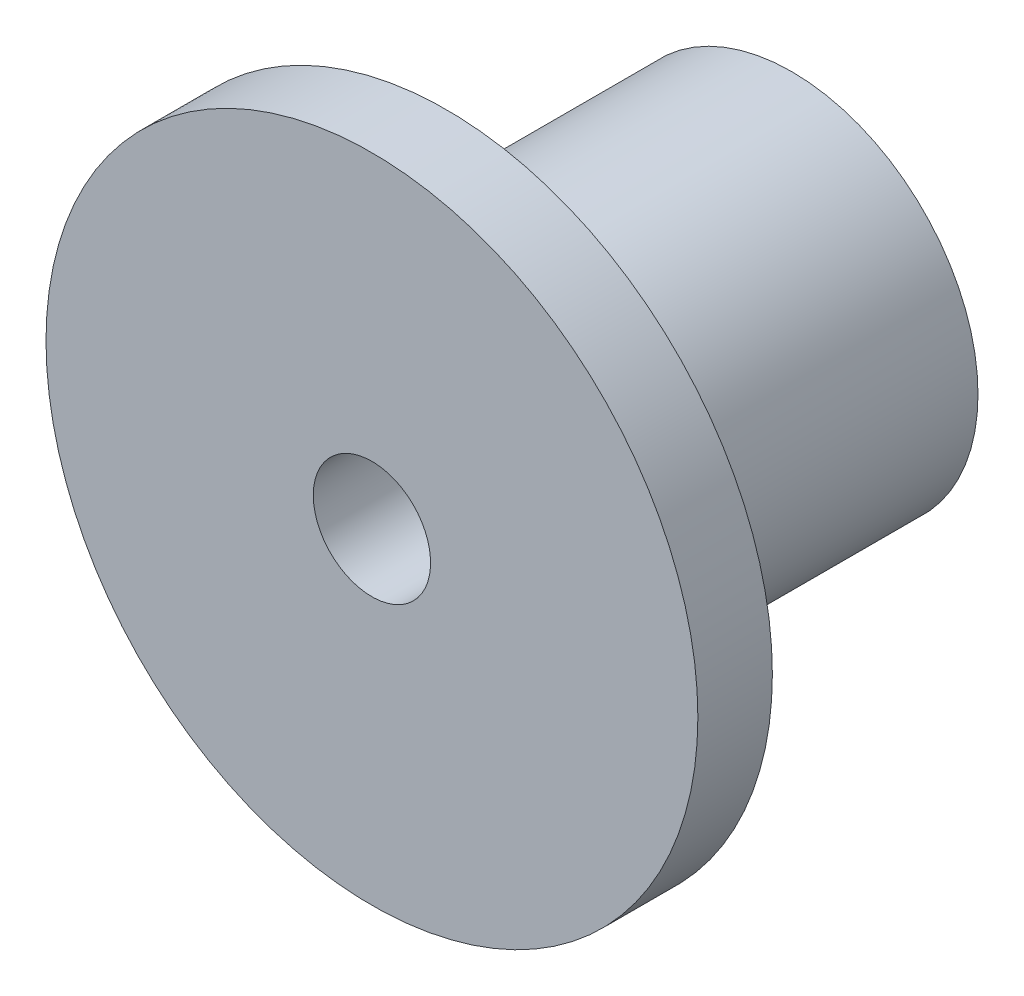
from build123d import *

# Parameters (mm, degrees)
SKETCH1_R    = 11.1125
FLANGE_DEPTH = 2.54
SKETCH2_R    = 6.35
HUB_DEPTH    = 14.3129
SKETCH3_R    = 2
HOLE_DEPTH   = 22.256397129


with BuildPart() as part:
    # Sketch1 → flange (new body)
    with BuildSketch(Plane.XY):
        Circle(SKETCH1_R)
    extrude(amount=FLANGE_DEPTH)

    # Sketch2 → hub (add)
    with BuildSketch(Plane.XY.offset(2.54)):
        Circle(SKETCH2_R)
    extrude(amount=-HUB_DEPTH)

    # Sketch3 → hole (cut, through all)
    with BuildSketch(Plane(origin=(0, 0, -11.7729), x_dir=(-1, 0, 0), z_dir=(0, 0, -1))):
        Circle(SKETCH3_R)
    extrude(amount=-HOLE_DEPTH, mode=Mode.SUBTRACT)


solid = part.part
